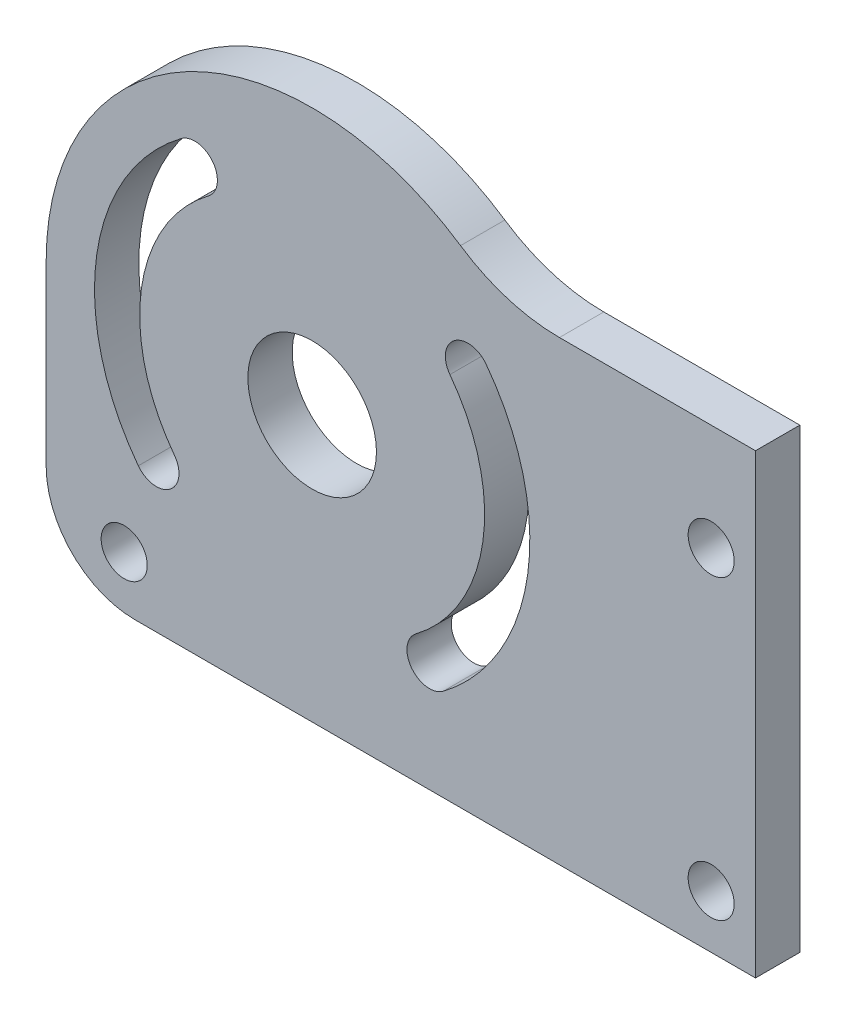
from build123d import *

# Parameters (mm, degrees)
ESQUISSE1_R             = 2.6
EXTRUSION1_DEPTH        = 5
ESQUISSE2_R             = 7.25
ENL_V_MAT_EXTRU_1_DEPTH = 51.249378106


with BuildPart() as part:
    # Esquisse1 → Extrusion1 (new body)
    with BuildSketch(Plane.XY):
        with BuildLine():
            Line((40, 21.5), (17.888169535, 21.5))
            ThreePointArc((17.888169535, 21.5), (12.05721764, 22.36887353), (6.732901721, 24.9))
            ThreePointArc((6.732901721, 24.9), (-24.106965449, 26.476282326), (-40, 0))
            Line((-40, 0), (-40, -20))
            ThreePointArc((-40, -20), (-37.071067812, -27.071067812), (-30, -30))
            Line((-30, -30), (40, -30))
            Line((40, -30), (40, 21.5))
        make_face()
        with Locations((35, 9.5)):
            Circle(ESQUISSE1_R, mode=Mode.SUBTRACT)
        with Locations((35, -24)):
            Circle(ESQUISSE1_R, mode=Mode.SUBTRACT)
        with Locations((-31.2, -24)):
            Circle(ESQUISSE1_R, mode=Mode.SUBTRACT)
    extrude(amount=EXTRUSION1_DEPTH)

    # Esquisse2 → Enl_v. mat.-Extru.1 (cut, through all)
    with BuildSketch(Plane.XY.offset(5)):
        with Locations((-10, 0)):
            Circle(ESQUISSE2_R)
        with BuildLine():
            ThreePointArc((9.606501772, 14.774558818), (6.035352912, 15.27645106), (5.53346067, 11.7053022))
            ThreePointArc((5.53346067, 11.7053022), (9.260713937, -2.706916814), (1.7053022, -15.53346067))
            ThreePointArc((1.7053022, -15.53346067), (1.203409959, -19.10460953), (4.774558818, -19.606501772))
            ThreePointArc((4.774558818, -19.606501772), (14.311081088, -3.416699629), (9.606501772, 14.774558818))
        make_face()
        with BuildLine():
            ThreePointArc((-25.53346067, -11.7053022), (-26.035352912, -15.27645106), (-29.606501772, -14.774558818))
            ThreePointArc((-29.606501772, -14.774558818), (-34.311081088, 3.416699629), (-24.774558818, 19.606501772))
            ThreePointArc((-24.774558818, 19.606501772), (-21.203409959, 19.10460953), (-21.7053022, 15.53346067))
            ThreePointArc((-21.7053022, 15.53346067), (-29.260713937, 2.706916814), (-25.53346067, -11.7053022))
        make_face()
    extrude(amount=-ENL_V_MAT_EXTRU_1_DEPTH, mode=Mode.SUBTRACT)


solid = part.part
